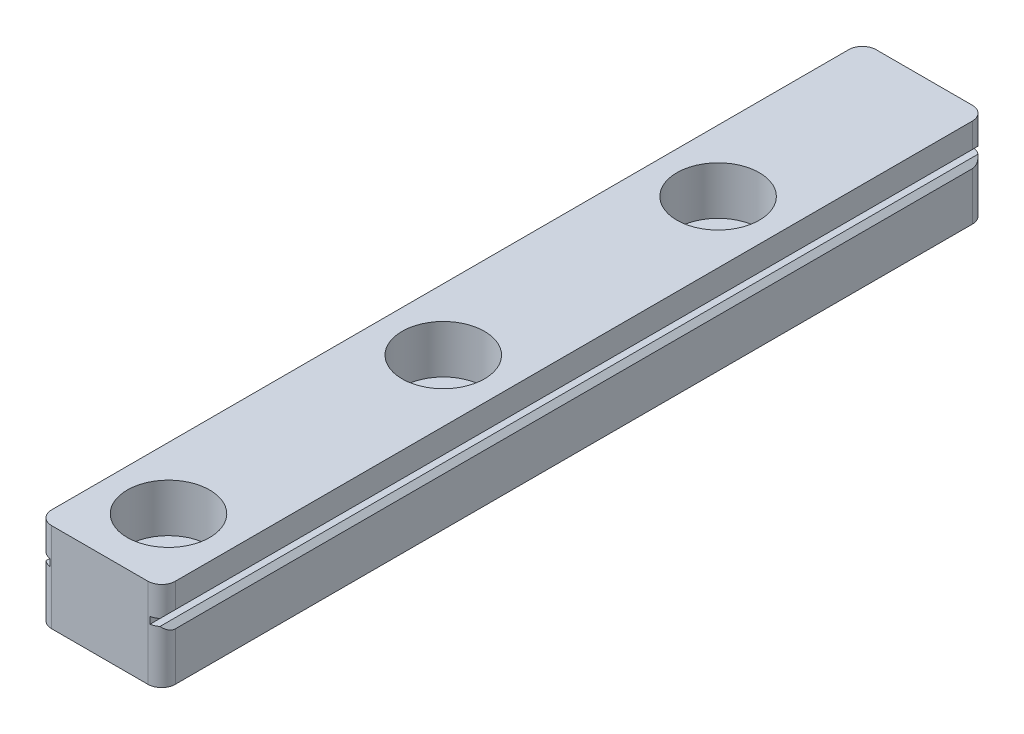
from build123d import *

# Parameters (mm, degrees)
EXTRUDE_2_DEPTH     = 60
SKETCH_3_R          = 3
CUT_EXTRUDE_1_DEPTH = 3.5
SKETCH_4_R          = 1.75
CUT_EXTRUDE_2_DEPTH = 3
FILLET_1_R          = 1


with BuildPart() as part:
    # Sketch 2 → Extrude 2 (new body)
    with BuildSketch(Plane.XY):
        Polygon((0, 0), (9, 0), (9, 3.5), (8.646446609, 3.853553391), (8.146446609, 3.853553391), (8.146446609, 4.353553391), (8.646446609, 4.353553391), (9, 4.707106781), (9, 6.5), (0, 6.5), (0, 4.707106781), (0.353553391, 4.353553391), (0.853553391, 4.353553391), (0.853553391, 3.853553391), (0.353553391, 3.853553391), (0, 3.5), align=None)
    extrude(amount=-EXTRUDE_2_DEPTH)

    # Sketch 3 → Cut-Extrude 1 (cut)
    with BuildSketch(Plane(origin=(0, 6.5, 0), x_dir=(1, 0, 0), z_dir=(0, 1, 0))):
        with Locations(Location((4.5, 5, 0), (0, 0, 270))):
            Circle(SKETCH_3_R)
        with Locations(Location((4.5, 25, 0), (0, 0, 270))):
            Circle(SKETCH_3_R)
        with Locations(Location((4.5, 45, 0), (0, 0, 270))):
            Circle(SKETCH_3_R)
        with Locations((4.5, 65)):
            Circle(SKETCH_3_R)
        with Locations((4.5, 85)):
            Circle(SKETCH_3_R)
        with Locations((4.5, 105)):
            Circle(SKETCH_3_R)
        with Locations((4.5, 125)):
            Circle(SKETCH_3_R)
        with Locations((4.5, 145)):
            Circle(SKETCH_3_R)
        with Locations((4.5, 165)):
            Circle(SKETCH_3_R)
        with Locations((4.5, 185)):
            Circle(SKETCH_3_R)
        with Locations((4.5, 205)):
            Circle(SKETCH_3_R)
        with Locations((4.5, 225)):
            Circle(SKETCH_3_R)
    extrude(amount=-CUT_EXTRUDE_1_DEPTH, mode=Mode.SUBTRACT)

    # Sketch 4 → Cut-Extrude 2 (cut)
    with BuildSketch(Plane(origin=(0, 3, 0), x_dir=(1, 0, 0), z_dir=(0, 1, 0))):
        with Locations(Location((4.5, 5, 0), (0, 0, 270))):
            Circle(SKETCH_4_R)
        with Locations(Location((4.5, 25, 0), (0, 0, 270))):
            Circle(SKETCH_4_R)
        with Locations(Location((4.5, 45, 0), (0, 0, 270))):
            Circle(SKETCH_4_R)
        with Locations((4.5, 65)):
            Circle(SKETCH_4_R)
        with Locations((4.5, 85)):
            Circle(SKETCH_4_R)
        with Locations((4.5, 105)):
            Circle(SKETCH_4_R)
        with Locations((4.5, 125)):
            Circle(SKETCH_4_R)
        with Locations((4.5, 145)):
            Circle(SKETCH_4_R)
        with Locations((4.5, 165)):
            Circle(SKETCH_4_R)
        with Locations((4.5, 185)):
            Circle(SKETCH_4_R)
        with Locations((4.5, 205)):
            Circle(SKETCH_4_R)
        with Locations((4.5, 225)):
            Circle(SKETCH_4_R)
    extrude(amount=-CUT_EXTRUDE_2_DEPTH, mode=Mode.SUBTRACT)

    # Fillet 1
    fillet_1_edges = [part.edges().sort_by_distance(p)[0] for p in [
        (9, 1.75, -60),
        (0, 1.75, -60),
        (9, 1.75, 0),
        (0, 1.75, 0),
    ]]
    fillet(fillet_1_edges, radius=FILLET_1_R)


solid = part.part
